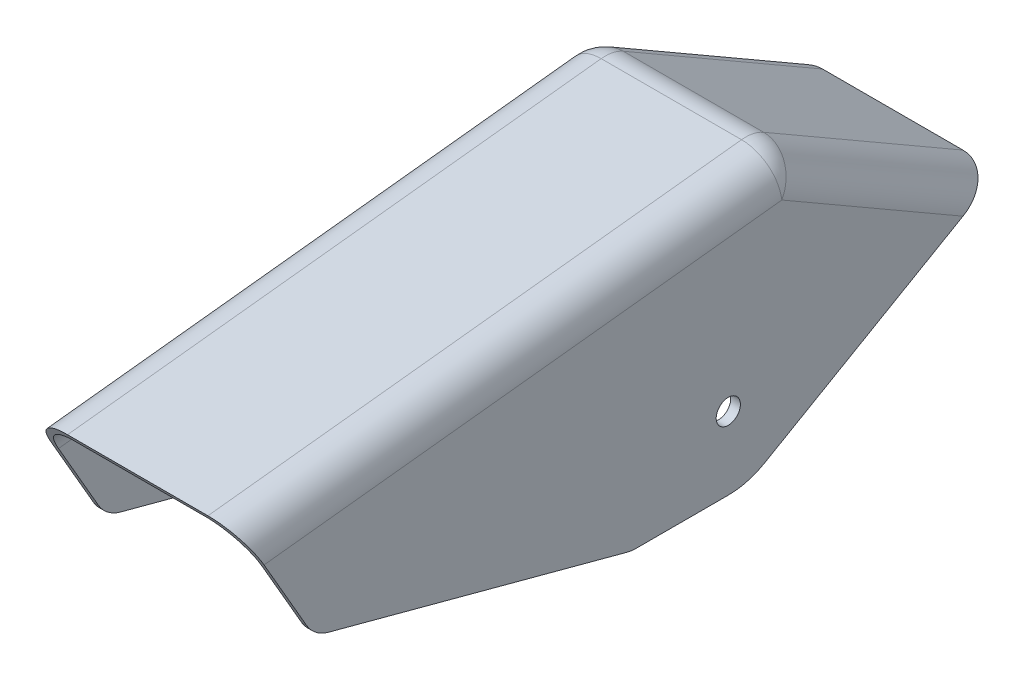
ISO-10303-21;
HEADER;
FILE_DESCRIPTION(('STEP AP214'),'2;1');
FILE_NAME('part.step','',(''),(''),'','','');
FILE_SCHEMA(('AUTOMOTIVE_DESIGN { 1 0 10303 214 1 1 1 1 }'));
ENDSEC;
DATA;
#1=APPLICATION_CONTEXT('core data for automotive mechanical design processes');
#2=APPLICATION_PROTOCOL_DEFINITION('international standard','automotive_design',2000,#1);
#3=PRODUCT_CONTEXT('',#1,'mechanical');
#4=PRODUCT('Part','Part','',(#3));
#5=PRODUCT_RELATED_PRODUCT_CATEGORY('part','',(#4));
#6=PRODUCT_DEFINITION_FORMATION('','',#4);
#7=PRODUCT_DEFINITION_CONTEXT('part definition',#1,'design');
#8=PRODUCT_DEFINITION('design','',#6,#7);
#9=PRODUCT_DEFINITION_SHAPE('','',#8);
#10=(LENGTH_UNIT() NAMED_UNIT(*) SI_UNIT(.MILLI.,.METRE.));
#11=(NAMED_UNIT(*) PLANE_ANGLE_UNIT() SI_UNIT($,.RADIAN.));
#12=(NAMED_UNIT(*) SI_UNIT($,.STERADIAN.) SOLID_ANGLE_UNIT());
#13=UNCERTAINTY_MEASURE_WITH_UNIT(LENGTH_MEASURE(1.E-05),#10,'distance_accuracy_value','');
#14=(GEOMETRIC_REPRESENTATION_CONTEXT(3) GLOBAL_UNCERTAINTY_ASSIGNED_CONTEXT((#13)) GLOBAL_UNIT_ASSIGNED_CONTEXT((#10,
#11,#12)) REPRESENTATION_CONTEXT('',''));
#15=CARTESIAN_POINT('',(0.,0.,0.));
#16=DIRECTION('',(0.,0.,1.));
#17=DIRECTION('',(1.,0.,0.));
#18=AXIS2_PLACEMENT_3D('',#15,#16,#17);
#19=CARTESIAN_POINT('',(210.,3.46944695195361E-13,0.));
#20=DIRECTION('',(1.,0.,0.));
#21=DIRECTION('',(0.,0.,-1.));
#22=AXIS2_PLACEMENT_3D('',#19,#20,#21);
#23=PLANE('',#22);
#24=CARTESIAN_POINT('',(210.,0.,0.));
#25=DIRECTION('',(1.,0.,0.));
#26=DIRECTION('',(0.,0.,-1.));
#27=AXIS2_PLACEMENT_3D('',#24,#25,#26);
#28=CIRCLE('',#27,35.);
#29=CARTESIAN_POINT('',(210.,0.,-35.));
#30=VERTEX_POINT('',#29);
#31=EDGE_CURVE('E365',#30,#30,#28,.T.);
#32=ORIENTED_EDGE('',*,*,#31,.T.);
#33=EDGE_LOOP('',(#32));
#34=FACE_BOUND('',#33,.T.);
#35=DIRECTION('',(0.,0.,-1.));
#36=VECTOR('',#35,1.);
#37=CARTESIAN_POINT('',(210.,-150.,0.));
#38=LINE('',#37,#36);
#39=CARTESIAN_POINT('',(210.,-150.,190.126062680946));
#40=VERTEX_POINT('',#39);
#41=CARTESIAN_POINT('',(210.,-150.,0.));
#42=VERTEX_POINT('',#41);
#43=EDGE_CURVE('E333',#40,#42,#38,.T.);
#44=ORIENTED_EDGE('',*,*,#43,.F.);
#45=CARTESIAN_POINT('',(210.,-75.,190.126062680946));
#46=DIRECTION('',(1.,0.,0.));
#47=DIRECTION('',(0.,0.,-1.));
#48=AXIS2_PLACEMENT_3D('',#45,#46,#47);
#49=CIRCLE('',#48,75.);
#50=CARTESIAN_POINT('',(210.,-147.44443697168,209.537491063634));
#51=VERTEX_POINT('',#50);
#52=EDGE_CURVE('E429',#40,#51,#49,.F.);
#53=ORIENTED_EDGE('',*,*,#52,.T.);
#54=DIRECTION('',(0.,0.258819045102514,0.96592582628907));
#55=VECTOR('',#54,1.);
#56=CARTESIAN_POINT('',(210.,-189.951905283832,50.8974596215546));
#57=LINE('',#56,#55);
#58=CARTESIAN_POINT('',(210.,17.6437424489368,825.65496439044));
#59=VERTEX_POINT('',#58);
#60=EDGE_CURVE('E350',#51,#59,#57,.T.);
#61=ORIENTED_EDGE('',*,*,#60,.T.);
#62=CARTESIAN_POINT('',(210.,90.0881794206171,806.243536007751));
#63=DIRECTION('',(1.,0.,0.));
#64=DIRECTION('',(0.,0.,-1.));
#65=AXIS2_PLACEMENT_3D('',#62,#63,#64);
#66=CIRCLE('',#65,75.);
#67=CARTESIAN_POINT('',(210.,52.5881794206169,871.195441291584));
#68=VERTEX_POINT('',#67);
#69=EDGE_CURVE('E427',#59,#68,#66,.F.);
#70=ORIENTED_EDGE('',*,*,#69,.T.);
#71=DIRECTION('',(0.,0.866025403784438,0.500000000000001));
#72=VECTOR('',#71,1.);
#73=CARTESIAN_POINT('',(210.,-364.0916470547,630.625231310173));
#74=LINE('',#73,#72);
#75=CARTESIAN_POINT('',(210.,195.289402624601,953.584030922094));
#76=VERTEX_POINT('',#75);
#77=EDGE_CURVE('E348',#68,#76,#74,.T.);
#78=ORIENTED_EDGE('',*,*,#77,.T.);
#79=DIRECTION('',(0.,-0.10966150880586,0.993968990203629));
#80=VECTOR('',#79,1.);
#81=CARTESIAN_POINT('',(210.,315.153191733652,-132.858155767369));
#82=LINE('',#81,#80);
#83=CARTESIAN_POINT('',(210.,312.457360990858,-108.423217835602));
#84=VERTEX_POINT('',#83);
#85=EDGE_CURVE('E380',#76,#84,#82,.F.);
#86=ORIENTED_EDGE('',*,*,#85,.T.);
#87=DIRECTION('',(0.,0.499999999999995,0.866025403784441));
#88=VECTOR('',#87,1.);
#89=CARTESIAN_POINT('',(210.,79.2745920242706,-512.307621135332));
#90=LINE('',#89,#88);
#91=CARTESIAN_POINT('',(210.,100.925227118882,-474.807621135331));
#92=VERTEX_POINT('',#91);
#93=EDGE_CURVE('E378',#84,#92,#90,.F.);
#94=ORIENTED_EDGE('',*,*,#93,.T.);
#95=DIRECTION('',(0.,-0.5,0.866025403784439));
#96=VECTOR('',#95,1.);
#97=CARTESIAN_POINT('',(210.,-129.903810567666,-75.));
#98=LINE('',#97,#96);
#99=CARTESIAN_POINT('',(210.,-129.903810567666,-75.));
#100=VERTEX_POINT('',#99);
#101=EDGE_CURVE('E346',#92,#100,#98,.T.);
#102=ORIENTED_EDGE('',*,*,#101,.T.);
#103=CARTESIAN_POINT('',(210.,3.46944695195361E-13,0.));
#104=DIRECTION('',(1.,0.,0.));
#105=DIRECTION('',(0.,0.,-1.));
#106=AXIS2_PLACEMENT_3D('',#103,#104,#105);
#107=CIRCLE('',#106,150.);
#108=EDGE_CURVE('E328',#42,#100,#107,.T.);
#109=ORIENTED_EDGE('',*,*,#108,.F.);
#110=EDGE_LOOP('',(#44,#53,#61,#70,#78,#86,#94,#102,#109));
#111=FACE_BOUND('',#110,.T.);
#112=ADVANCED_FACE('F90',(#34,#111),#23,.F.);
#113=CARTESIAN_POINT('',(210.,0.,0.));
#114=DIRECTION('',(-1.,0.,0.));
#115=DIRECTION('',(0.,0.,1.));
#116=AXIS2_PLACEMENT_3D('',#113,#114,#115);
#117=CYLINDRICAL_SURFACE('',#116,25.);
#118=CARTESIAN_POINT('',(200.,0.,0.));
#119=DIRECTION('',(1.,0.,0.));
#120=DIRECTION('',(0.,0.,-1.));
#121=AXIS2_PLACEMENT_3D('',#118,#119,#120);
#122=CIRCLE('',#121,25.);
#123=CARTESIAN_POINT('',(200.,0.,-25.));
#124=VERTEX_POINT('',#123);
#125=EDGE_CURVE('E364',#124,#124,#122,.T.);
#126=ORIENTED_EDGE('',*,*,#125,.F.);
#127=EDGE_LOOP('',(#126));
#128=FACE_BOUND('',#127,.T.);
#129=CARTESIAN_POINT('',(220.,0.,0.));
#130=DIRECTION('',(1.,0.,0.));
#131=DIRECTION('',(0.,0.,-1.));
#132=AXIS2_PLACEMENT_3D('',#129,#130,#131);
#133=CIRCLE('',#132,25.);
#134=CARTESIAN_POINT('',(220.,0.,-25.));
#135=VERTEX_POINT('',#134);
#136=EDGE_CURVE('E325',#135,#135,#133,.T.);
#137=ORIENTED_EDGE('',*,*,#136,.T.);
#138=EDGE_LOOP('',(#137));
#139=FACE_BOUND('',#138,.T.);
#140=ADVANCED_FACE('F582',(#128,#139),#117,.F.);
#141=CARTESIAN_POINT('',(210.,0.,0.));
#142=DIRECTION('',(-1.,0.,0.));
#143=DIRECTION('',(0.,0.,1.));
#144=AXIS2_PLACEMENT_3D('',#141,#142,#143);
#145=CYLINDRICAL_SURFACE('',#144,35.);
#146=ORIENTED_EDGE('',*,*,#31,.F.);
#147=EDGE_LOOP('',(#146));
#148=FACE_BOUND('',#147,.T.);
#149=CARTESIAN_POINT('',(200.,0.,0.));
#150=DIRECTION('',(1.,0.,0.));
#151=DIRECTION('',(0.,0.,-1.));
#152=AXIS2_PLACEMENT_3D('',#149,#150,#151);
#153=CIRCLE('',#152,35.);
#154=CARTESIAN_POINT('',(200.,0.,-35.));
#155=VERTEX_POINT('',#154);
#156=EDGE_CURVE('E369',#155,#155,#153,.T.);
#157=ORIENTED_EDGE('',*,*,#156,.T.);
#158=EDGE_LOOP('',(#157));
#159=FACE_BOUND('',#158,.T.);
#160=ADVANCED_FACE('F588',(#148,#159),#145,.T.);
#161=CARTESIAN_POINT('',(200.,0.,0.));
#162=DIRECTION('',(1.,0.,0.));
#163=DIRECTION('',(0.,0.,-1.));
#164=AXIS2_PLACEMENT_3D('',#161,#162,#163);
#165=PLANE('',#164);
#166=ORIENTED_EDGE('',*,*,#125,.T.);
#167=EDGE_LOOP('',(#166));
#168=FACE_BOUND('',#167,.T.);
#169=ORIENTED_EDGE('',*,*,#156,.F.);
#170=EDGE_LOOP('',(#169));
#171=FACE_BOUND('',#170,.T.);
#172=ADVANCED_FACE('F608',(#168,#171),#165,.F.);
#173=CARTESIAN_POINT('',(220.,3.46944695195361E-13,0.));
#174=DIRECTION('',(1.,0.,0.));
#175=DIRECTION('',(0.,0.,-1.));
#176=AXIS2_PLACEMENT_3D('',#173,#174,#175);
#177=PLANE('',#176);
#178=DIRECTION('',(0.,0.258819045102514,0.96592582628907));
#179=VECTOR('',#178,1.);
#180=CARTESIAN_POINT('',(220.,-189.951905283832,50.8974596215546));
#181=LINE('',#180,#179);
#182=CARTESIAN_POINT('',(220.,-147.44443697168,209.537491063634));
#183=VERTEX_POINT('',#182);
#184=CARTESIAN_POINT('',(220.,17.6437424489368,825.65496439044));
#185=VERTEX_POINT('',#184);
#186=EDGE_CURVE('E338',#183,#185,#181,.T.);
#187=ORIENTED_EDGE('',*,*,#186,.F.);
#188=CARTESIAN_POINT('',(220.,-75.,190.126062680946));
#189=DIRECTION('',(1.,0.,0.));
#190=DIRECTION('',(0.,0.,-1.));
#191=AXIS2_PLACEMENT_3D('',#188,#189,#190);
#192=CIRCLE('',#191,75.);
#193=CARTESIAN_POINT('',(220.,-150.,190.126062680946));
#194=VERTEX_POINT('',#193);
#195=EDGE_CURVE('E442',#183,#194,#192,.T.);
#196=ORIENTED_EDGE('',*,*,#195,.T.);
#197=DIRECTION('',(0.,0.,-1.));
#198=VECTOR('',#197,1.);
#199=CARTESIAN_POINT('',(220.,-150.,0.));
#200=LINE('',#199,#198);
#201=CARTESIAN_POINT('',(220.,-150.,0.));
#202=VERTEX_POINT('',#201);
#203=EDGE_CURVE('E341',#194,#202,#200,.T.);
#204=ORIENTED_EDGE('',*,*,#203,.T.);
#205=CARTESIAN_POINT('',(220.,3.46944695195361E-13,0.));
#206=DIRECTION('',(1.,0.,0.));
#207=DIRECTION('',(0.,0.,-1.));
#208=AXIS2_PLACEMENT_3D('',#205,#206,#207);
#209=CIRCLE('',#208,150.);
#210=CARTESIAN_POINT('',(220.,-129.903810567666,-75.));
#211=VERTEX_POINT('',#210);
#212=EDGE_CURVE('E329',#202,#211,#209,.T.);
#213=ORIENTED_EDGE('',*,*,#212,.T.);
#214=DIRECTION('',(0.,-0.5,0.866025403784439));
#215=VECTOR('',#214,1.);
#216=CARTESIAN_POINT('',(220.,-129.903810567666,-75.));
#217=LINE('',#216,#215);
#218=CARTESIAN_POINT('',(220.,106.698729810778,-484.807621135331));
#219=VERTEX_POINT('',#218);
#220=EDGE_CURVE('E332',#219,#211,#217,.T.);
#221=ORIENTED_EDGE('',*,*,#220,.F.);
#222=DIRECTION('',(0.,-0.499999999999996,-0.866025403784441));
#223=VECTOR('',#222,1.);
#224=CARTESIAN_POINT('',(220.,289.951905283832,-167.403810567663));
#225=LINE('',#224,#223);
#226=CARTESIAN_POINT('',(220.,322.756494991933,-110.58459447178));
#227=VERTEX_POINT('',#226);
#228=EDGE_CURVE('E436',#219,#227,#225,.F.);
#229=ORIENTED_EDGE('',*,*,#228,.T.);
#230=DIRECTION('',(0.,0.10966150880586,-0.993968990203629));
#231=VECTOR('',#230,1.);
#232=CARTESIAN_POINT('',(220.,306.8214032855,33.8506516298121));
#233=LINE('',#232,#231);
#234=CARTESIAN_POINT('',(220.,204.74761635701,959.044733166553));
#235=VERTEX_POINT('',#234);
#236=EDGE_CURVE('E438',#227,#235,#233,.F.);
#237=ORIENTED_EDGE('',*,*,#236,.T.);
#238=DIRECTION('',(0.,0.866025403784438,0.500000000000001));
#239=VECTOR('',#238,1.);
#240=CARTESIAN_POINT('',(220.,-364.0916470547,630.625231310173));
#241=LINE('',#240,#239);
#242=CARTESIAN_POINT('',(220.,52.5881794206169,871.195441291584));
#243=VERTEX_POINT('',#242);
#244=EDGE_CURVE('E335',#243,#235,#241,.T.);
#245=ORIENTED_EDGE('',*,*,#244,.F.);
#246=CARTESIAN_POINT('',(220.,90.0881794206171,806.243536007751));
#247=DIRECTION('',(1.,0.,0.));
#248=DIRECTION('',(0.,0.,-1.));
#249=AXIS2_PLACEMENT_3D('',#246,#247,#248);
#250=CIRCLE('',#249,75.);
#251=EDGE_CURVE('E440',#243,#185,#250,.T.);
#252=ORIENTED_EDGE('',*,*,#251,.T.);
#253=EDGE_LOOP('',(#187,#196,#204,#213,#221,#229,#237,#245,#252));
#254=FACE_BOUND('',#253,.T.);
#255=ORIENTED_EDGE('',*,*,#136,.F.);
#256=EDGE_LOOP('',(#255));
#257=FACE_BOUND('',#256,.T.);
#258=ADVANCED_FACE('F501',(#254,#257),#177,.T.);
#259=CARTESIAN_POINT('',(220.,3.46944695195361E-13,0.));
#260=DIRECTION('',(-1.,0.,0.));
#261=DIRECTION('',(0.,0.,1.));
#262=AXIS2_PLACEMENT_3D('',#259,#260,#261);
#263=CYLINDRICAL_SURFACE('',#262,150.);
#264=ORIENTED_EDGE('',*,*,#108,.T.);
#265=DIRECTION('',(-1.,0.,0.));
#266=VECTOR('',#265,1.);
#267=CARTESIAN_POINT('',(220.,-129.903810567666,-75.));
#268=LINE('',#267,#266);
#269=EDGE_CURVE('E361',#211,#100,#268,.T.);
#270=ORIENTED_EDGE('',*,*,#269,.F.);
#271=ORIENTED_EDGE('',*,*,#212,.F.);
#272=DIRECTION('',(-1.,0.,0.));
#273=VECTOR('',#272,1.);
#274=CARTESIAN_POINT('',(220.,-150.,0.));
#275=LINE('',#274,#273);
#276=EDGE_CURVE('E343',#202,#42,#275,.T.);
#277=ORIENTED_EDGE('',*,*,#276,.T.);
#278=EDGE_LOOP('',(#264,#270,#271,#277));
#279=FACE_BOUND('',#278,.T.);
#280=ADVANCED_FACE('F529',(#279),#263,.T.);
#281=CARTESIAN_POINT('',(220.,-129.903810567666,-75.));
#282=DIRECTION('',(0.,-0.866025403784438,-0.5));
#283=DIRECTION('',(0.,0.5,-0.866025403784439));
#284=AXIS2_PLACEMENT_3D('',#281,#282,#283);
#285=PLANE('',#284);
#286=DIRECTION('',(-1.,0.,0.));
#287=VECTOR('',#286,1.);
#288=CARTESIAN_POINT('',(220.,150.,-559.807621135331));
#289=LINE('',#288,#287);
#290=CARTESIAN_POINT('',(145.,150.,-559.807621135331));
#291=VERTEX_POINT('',#290);
#292=CARTESIAN_POINT('',(-145.,150.,-559.807621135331));
#293=VERTEX_POINT('',#292);
#294=EDGE_CURVE('E359',#291,#293,#289,.T.);
#295=ORIENTED_EDGE('',*,*,#294,.F.);
#296=CARTESIAN_POINT('',(145.,106.698729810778,-484.807621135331));
#297=DIRECTION('',(0.,-0.866025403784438,-0.5));
#298=DIRECTION('',(0.,0.5,-0.866025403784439));
#299=AXIS2_PLACEMENT_3D('',#296,#297,#298);
#300=ELLIPSE('',#299,86.6025403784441,75.);
#301=EDGE_CURVE('E12',#291,#219,#300,.T.);
#302=ORIENTED_EDGE('',*,*,#301,.T.);
#303=ORIENTED_EDGE('',*,*,#220,.T.);
#304=ORIENTED_EDGE('',*,*,#269,.T.);
#305=ORIENTED_EDGE('',*,*,#101,.F.);
#306=CARTESIAN_POINT('',(135.,100.925227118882,-474.807621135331));
#307=DIRECTION('',(0.,-0.866025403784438,-0.5));
#308=DIRECTION('',(0.,0.5,-0.866025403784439));
#309=AXIS2_PLACEMENT_3D('',#306,#307,#308);
#310=ELLIPSE('',#309,86.6025403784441,75.);
#311=CARTESIAN_POINT('',(135.,144.226497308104,-549.807621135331));
#312=VERTEX_POINT('',#311);
#313=EDGE_CURVE('E394',#92,#312,#310,.F.);
#314=ORIENTED_EDGE('',*,*,#313,.T.);
#315=DIRECTION('',(-1.,0.,0.));
#316=VECTOR('',#315,1.);
#317=CARTESIAN_POINT('',(220.,144.226497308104,-549.807621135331));
#318=LINE('',#317,#316);
#319=CARTESIAN_POINT('',(-135.,144.226497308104,-549.807621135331));
#320=VERTEX_POINT('',#319);
#321=EDGE_CURVE('E316',#312,#320,#318,.T.);
#322=ORIENTED_EDGE('',*,*,#321,.T.);
#323=CARTESIAN_POINT('',(-135.,100.925227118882,-474.807621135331));
#324=DIRECTION('',(0.,-0.866025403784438,-0.5));
#325=DIRECTION('',(0.,0.5,-0.866025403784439));
#326=AXIS2_PLACEMENT_3D('',#323,#324,#325);
#327=ELLIPSE('',#326,86.6025403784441,75.);
#328=CARTESIAN_POINT('',(-210.,100.925227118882,-474.807621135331));
#329=VERTEX_POINT('',#328);
#330=EDGE_CURVE('E396',#320,#329,#327,.F.);
#331=ORIENTED_EDGE('',*,*,#330,.T.);
#332=DIRECTION('',(0.,0.5,-0.866025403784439));
#333=VECTOR('',#332,1.);
#334=CARTESIAN_POINT('',(-210.,-129.903810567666,-75.));
#335=LINE('',#334,#333);
#336=CARTESIAN_POINT('',(-210.,-129.903810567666,-75.0000000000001));
#337=VERTEX_POINT('',#336);
#338=EDGE_CURVE('E277',#337,#329,#335,.T.);
#339=ORIENTED_EDGE('',*,*,#338,.F.);
#340=DIRECTION('',(1.,0.,0.));
#341=VECTOR('',#340,1.);
#342=CARTESIAN_POINT('',(-220.,-129.903810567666,-75.0000000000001));
#343=LINE('',#342,#341);
#344=CARTESIAN_POINT('',(-220.,-129.903810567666,-75.0000000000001));
#345=VERTEX_POINT('',#344);
#346=EDGE_CURVE('E273',#345,#337,#343,.T.);
#347=ORIENTED_EDGE('',*,*,#346,.F.);
#348=DIRECTION('',(0.,0.499999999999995,-0.866025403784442));
#349=VECTOR('',#348,1.);
#350=CARTESIAN_POINT('',(-220.,144.226497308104,-549.807621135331));
#351=LINE('',#350,#349);
#352=CARTESIAN_POINT('',(-220.,106.698729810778,-484.807621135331));
#353=VERTEX_POINT('',#352);
#354=EDGE_CURVE('E258',#345,#353,#351,.T.);
#355=ORIENTED_EDGE('',*,*,#354,.T.);
#356=CARTESIAN_POINT('',(-145.,106.698729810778,-484.807621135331));
#357=DIRECTION('',(0.,-0.866025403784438,-0.5));
#358=DIRECTION('',(0.,-0.5,0.866025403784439));
#359=AXIS2_PLACEMENT_3D('',#356,#357,#358);
#360=ELLIPSE('',#359,86.6025403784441,75.);
#361=EDGE_CURVE('E99',#353,#293,#360,.T.);
#362=ORIENTED_EDGE('',*,*,#361,.T.);
#363=EDGE_LOOP('',(#295,#302,#303,#304,#305,#314,#322,#331,#339,#347,#355,#362));
#364=FACE_BOUND('',#363,.T.);
#365=ADVANCED_FACE('F275',(#364),#285,.T.);
#366=CARTESIAN_POINT('',(220.,354.903810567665,-204.903810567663));
#367=DIRECTION('',(0.,0.866025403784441,-0.499999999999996));
#368=DIRECTION('',(0.,0.499999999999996,0.866025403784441));
#369=AXIS2_PLACEMENT_3D('',#366,#367,#368);
#370=PLANE('',#369);
#371=DIRECTION('',(-1.,0.,0.));
#372=VECTOR('',#371,1.);
#373=CARTESIAN_POINT('',(220.,387.708400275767,-148.084594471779));
#374=LINE('',#373,#372);
#375=CARTESIAN_POINT('',(-145.,387.708400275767,-148.084594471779));
#376=VERTEX_POINT('',#375);
#377=CARTESIAN_POINT('',(145.,387.708400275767,-148.084594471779));
#378=VERTEX_POINT('',#377);
#379=EDGE_CURVE('E107',#376,#378,#374,.F.);
#380=ORIENTED_EDGE('',*,*,#379,.T.);
#381=DIRECTION('',(0.,-0.499999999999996,-0.866025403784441));
#382=VECTOR('',#381,1.);
#383=CARTESIAN_POINT('',(145.,354.903810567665,-204.903810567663));
#384=LINE('',#383,#382);
#385=EDGE_CURVE('E462',#378,#291,#384,.T.);
#386=ORIENTED_EDGE('',*,*,#385,.T.);
#387=ORIENTED_EDGE('',*,*,#294,.T.);
#388=DIRECTION('',(0.,0.499999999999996,0.866025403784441));
#389=VECTOR('',#388,1.);
#390=CARTESIAN_POINT('',(-145.,354.903810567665,-204.903810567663));
#391=LINE('',#390,#389);
#392=EDGE_CURVE('E112',#293,#376,#391,.T.);
#393=ORIENTED_EDGE('',*,*,#392,.T.);
#394=EDGE_LOOP('',(#380,#386,#387,#393));
#395=FACE_BOUND('',#394,.T.);
#396=ADVANCED_FACE('F531',(#395),#370,.T.);
#397=CARTESIAN_POINT('',(220.,381.369077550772,42.0752647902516));
#398=DIRECTION('',(0.,0.993968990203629,0.10966150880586));
#399=DIRECTION('',(0.,-0.10966150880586,0.993968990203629));
#400=AXIS2_PLACEMENT_3D('',#397,#398,#399);
#401=PLANE('',#400);
#402=DIRECTION('',(-1.,0.,0.));
#403=VECTOR('',#402,1.);
#404=CARTESIAN_POINT('',(220.,275.68421935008,1000.));
#405=LINE('',#404,#403);
#406=CARTESIAN_POINT('',(145.,275.68421935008,1000.));
#407=VERTEX_POINT('',#406);
#408=CARTESIAN_POINT('',(-145.,275.68421935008,1000.));
#409=VERTEX_POINT('',#408);
#410=EDGE_CURVE('E356',#407,#409,#405,.T.);
#411=ORIENTED_EDGE('',*,*,#410,.F.);
#412=DIRECTION('',(0.,0.10966150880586,-0.993968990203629));
#413=VECTOR('',#412,1.);
#414=CARTESIAN_POINT('',(145.,381.369077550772,42.0752647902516));
#415=LINE('',#414,#413);
#416=CARTESIAN_POINT('',(145.,397.304169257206,-102.35998131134));
#417=VERTEX_POINT('',#416);
#418=EDGE_CURVE('E458',#407,#417,#415,.T.);
#419=ORIENTED_EDGE('',*,*,#418,.T.);
#420=DIRECTION('',(-1.,0.,0.));
#421=VECTOR('',#420,1.);
#422=CARTESIAN_POINT('',(220.,397.304169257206,-102.35998131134));
#423=LINE('',#422,#421);
#424=CARTESIAN_POINT('',(-145.,397.304169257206,-102.35998131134));
#425=VERTEX_POINT('',#424);
#426=EDGE_CURVE('E455',#417,#425,#423,.T.);
#427=ORIENTED_EDGE('',*,*,#426,.T.);
#428=DIRECTION('',(0.,-0.10966150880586,0.993968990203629));
#429=VECTOR('',#428,1.);
#430=CARTESIAN_POINT('',(-145.,381.369077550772,42.0752647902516));
#431=LINE('',#430,#429);
#432=EDGE_CURVE('E453',#425,#409,#431,.T.);
#433=ORIENTED_EDGE('',*,*,#432,.T.);
#434=EDGE_LOOP('',(#411,#419,#427,#433));
#435=FACE_BOUND('',#434,.T.);
#436=ADVANCED_FACE('F491',(#435),#401,.T.);
#437=CARTESIAN_POINT('',(220.,-364.0916470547,630.625231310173));
#438=DIRECTION('',(0.,-0.500000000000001,0.866025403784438));
#439=DIRECTION('',(0.,-0.866025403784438,-0.500000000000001));
#440=AXIS2_PLACEMENT_3D('',#437,#438,#439);
#441=PLANE('',#440);
#442=ORIENTED_EDGE('',*,*,#77,.F.);
#443=DIRECTION('',(-1.,0.,0.));
#444=VECTOR('',#443,1.);
#445=CARTESIAN_POINT('',(220.,52.5881794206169,871.195441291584));
#446=LINE('',#445,#444);
#447=EDGE_CURVE('E451',#68,#243,#446,.F.);
#448=ORIENTED_EDGE('',*,*,#447,.T.);
#449=ORIENTED_EDGE('',*,*,#244,.T.);
#450=CARTESIAN_POINT('',(145.,204.74761635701,959.044733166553));
#451=DIRECTION('',(0.,-0.500000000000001,0.866025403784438));
#452=DIRECTION('',(0.,-0.866025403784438,-0.500000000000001));
#453=AXIS2_PLACEMENT_3D('',#450,#451,#452);
#454=ELLIPSE('',#453,81.9105336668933,75.);
#455=EDGE_CURVE('E446',#235,#407,#454,.T.);
#456=ORIENTED_EDGE('',*,*,#455,.T.);
#457=ORIENTED_EDGE('',*,*,#410,.T.);
#458=CARTESIAN_POINT('',(-145.,204.74761635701,959.044733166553));
#459=DIRECTION('',(0.,-0.500000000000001,0.866025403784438));
#460=DIRECTION('',(0.,0.866025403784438,0.500000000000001));
#461=AXIS2_PLACEMENT_3D('',#458,#459,#460);
#462=ELLIPSE('',#461,81.9105336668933,75.);
#463=CARTESIAN_POINT('',(-220.,204.747616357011,959.044733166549));
#464=VERTEX_POINT('',#463);
#465=EDGE_CURVE('E444',#409,#464,#462,.T.);
#466=ORIENTED_EDGE('',*,*,#465,.T.);
#467=DIRECTION('',(0.,-0.866025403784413,-0.500000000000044));
#468=VECTOR('',#467,1.);
#469=CARTESIAN_POINT('',(-220.,275.68421935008,1000.));
#470=LINE('',#469,#468);
#471=CARTESIAN_POINT('',(-220.,52.5881794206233,871.195441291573));
#472=VERTEX_POINT('',#471);
#473=EDGE_CURVE('E269',#464,#472,#470,.T.);
#474=ORIENTED_EDGE('',*,*,#473,.T.);
#475=DIRECTION('',(1.,0.,0.));
#476=VECTOR('',#475,1.);
#477=CARTESIAN_POINT('',(220.,52.5881794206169,871.195441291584));
#478=LINE('',#477,#476);
#479=CARTESIAN_POINT('',(-210.,52.5881794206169,871.195441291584));
#480=VERTEX_POINT('',#479);
#481=EDGE_CURVE('E448',#472,#480,#478,.T.);
#482=ORIENTED_EDGE('',*,*,#481,.T.);
#483=DIRECTION('',(0.,-0.866025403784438,-0.500000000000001));
#484=VECTOR('',#483,1.);
#485=CARTESIAN_POINT('',(-210.,-364.0916470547,630.625231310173));
#486=LINE('',#485,#484);
#487=CARTESIAN_POINT('',(-210.,195.289402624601,953.584030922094));
#488=VERTEX_POINT('',#487);
#489=EDGE_CURVE('E301',#488,#480,#486,.T.);
#490=ORIENTED_EDGE('',*,*,#489,.F.);
#491=CARTESIAN_POINT('',(-135.,195.289402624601,953.584030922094));
#492=DIRECTION('',(0.,-0.500000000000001,0.866025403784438));
#493=DIRECTION('',(0.,-0.866025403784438,-0.500000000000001));
#494=AXIS2_PLACEMENT_3D('',#491,#492,#493);
#495=ELLIPSE('',#494,81.9105336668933,75.);
#496=CARTESIAN_POINT('',(-135.,266.226005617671,994.53929775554));
#497=VERTEX_POINT('',#496);
#498=EDGE_CURVE('E398',#488,#497,#495,.F.);
#499=ORIENTED_EDGE('',*,*,#498,.T.);
#500=DIRECTION('',(-1.,0.,0.));
#501=VECTOR('',#500,1.);
#502=CARTESIAN_POINT('',(220.,266.226005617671,994.53929775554));
#503=LINE('',#502,#501);
#504=CARTESIAN_POINT('',(135.,266.226005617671,994.53929775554));
#505=VERTEX_POINT('',#504);
#506=EDGE_CURVE('E322',#505,#497,#503,.T.);
#507=ORIENTED_EDGE('',*,*,#506,.F.);
#508=CARTESIAN_POINT('',(135.,195.289402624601,953.584030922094));
#509=DIRECTION('',(0.,-0.500000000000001,0.866025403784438));
#510=DIRECTION('',(0.,-0.866025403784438,-0.500000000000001));
#511=AXIS2_PLACEMENT_3D('',#508,#509,#510);
#512=ELLIPSE('',#511,81.9105336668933,75.);
#513=EDGE_CURVE('E391',#505,#76,#512,.F.);
#514=ORIENTED_EDGE('',*,*,#513,.T.);
#515=EDGE_LOOP('',(#442,#448,#449,#456,#457,#466,#474,#482,#490,#499,#507,#514));
#516=FACE_BOUND('',#515,.T.);
#517=ADVANCED_FACE('F507',(#516),#441,.T.);
#518=CARTESIAN_POINT('',(220.,-189.951905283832,50.8974596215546));
#519=DIRECTION('',(0.,-0.96592582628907,0.258819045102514));
#520=DIRECTION('',(0.,-0.258819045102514,-0.96592582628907));
#521=AXIS2_PLACEMENT_3D('',#518,#519,#520);
#522=PLANE('',#521);
#523=ORIENTED_EDGE('',*,*,#60,.F.);
#524=DIRECTION('',(-1.,0.,0.));
#525=VECTOR('',#524,1.);
#526=CARTESIAN_POINT('',(220.,-147.44443697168,209.537491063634));
#527=LINE('',#526,#525);
#528=EDGE_CURVE('E434',#51,#183,#527,.F.);
#529=ORIENTED_EDGE('',*,*,#528,.T.);
#530=ORIENTED_EDGE('',*,*,#186,.T.);
#531=DIRECTION('',(-1.,0.,0.));
#532=VECTOR('',#531,1.);
#533=CARTESIAN_POINT('',(220.,17.6437424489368,825.65496439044));
#534=LINE('',#533,#532);
#535=EDGE_CURVE('E431',#185,#59,#534,.T.);
#536=ORIENTED_EDGE('',*,*,#535,.T.);
#537=EDGE_LOOP('',(#523,#529,#530,#536));
#538=FACE_BOUND('',#537,.T.);
#539=ADVANCED_FACE('F515',(#538),#522,.T.);
#540=CARTESIAN_POINT('',(220.,-150.,0.));
#541=DIRECTION('',(0.,1.,0.));
#542=DIRECTION('',(0.,0.,1.));
#543=AXIS2_PLACEMENT_3D('',#540,#541,#542);
#544=PLANE('',#543);
#545=ORIENTED_EDGE('',*,*,#203,.F.);
#546=DIRECTION('',(-1.,0.,0.));
#547=VECTOR('',#546,1.);
#548=CARTESIAN_POINT('',(210.,-150.,190.126062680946));
#549=LINE('',#548,#547);
#550=EDGE_CURVE('E424',#194,#40,#549,.T.);
#551=ORIENTED_EDGE('',*,*,#550,.T.);
#552=ORIENTED_EDGE('',*,*,#43,.T.);
#553=ORIENTED_EDGE('',*,*,#276,.F.);
#554=EDGE_LOOP('',(#545,#551,#552,#553));
#555=FACE_BOUND('',#554,.T.);
#556=ADVANCED_FACE('F523',(#555),#544,.F.);
#557=CARTESIAN_POINT('',(220.,389.700865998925,-124.633542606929));
#558=DIRECTION('',(0.,0.866025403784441,-0.499999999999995));
#559=DIRECTION('',(0.,0.499999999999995,0.866025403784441));
#560=AXIS2_PLACEMENT_3D('',#557,#558,#559);
#561=PLANE('',#560);
#562=ORIENTED_EDGE('',*,*,#321,.F.);
#563=DIRECTION('',(0.,0.499999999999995,0.866025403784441));
#564=VECTOR('',#563,1.);
#565=CARTESIAN_POINT('',(135.,389.700865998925,-124.633542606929));
#566=LINE('',#565,#564);
#567=CARTESIAN_POINT('',(135.,389.700865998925,-124.633542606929));
#568=VERTEX_POINT('',#567);
#569=EDGE_CURVE('E385',#312,#568,#566,.T.);
#570=ORIENTED_EDGE('',*,*,#569,.T.);
#571=DIRECTION('',(-1.,0.,0.));
#572=VECTOR('',#571,1.);
#573=CARTESIAN_POINT('',(220.,389.700865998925,-124.633542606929));
#574=LINE('',#573,#572);
#575=CARTESIAN_POINT('',(-135.,389.700865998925,-124.633542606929));
#576=VERTEX_POINT('',#575);
#577=EDGE_CURVE('E319',#568,#576,#574,.T.);
#578=ORIENTED_EDGE('',*,*,#577,.T.);
#579=DIRECTION('',(0.,-0.499999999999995,-0.866025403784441));
#580=VECTOR('',#579,1.);
#581=CARTESIAN_POINT('',(-135.,389.700865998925,-124.633542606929));
#582=LINE('',#581,#580);
#583=EDGE_CURVE('E382',#576,#320,#582,.T.);
#584=ORIENTED_EDGE('',*,*,#583,.T.);
#585=EDGE_LOOP('',(#562,#570,#578,#584));
#586=FACE_BOUND('',#585,.T.);
#587=ADVANCED_FACE('F564',(#586),#561,.F.);
#588=CARTESIAN_POINT('',(220.,266.226005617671,994.53929775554));
#589=DIRECTION('',(0.,0.993968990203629,0.10966150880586));
#590=DIRECTION('',(0.,-0.10966150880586,0.993968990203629));
#591=AXIS2_PLACEMENT_3D('',#588,#589,#590);
#592=PLANE('',#591);
#593=ORIENTED_EDGE('',*,*,#577,.F.);
#594=DIRECTION('',(0.,-0.10966150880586,0.993968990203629));
#595=VECTOR('',#594,1.);
#596=CARTESIAN_POINT('',(135.,266.226005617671,994.53929775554));
#597=LINE('',#596,#595);
#598=EDGE_CURVE('E375',#568,#505,#597,.T.);
#599=ORIENTED_EDGE('',*,*,#598,.T.);
#600=ORIENTED_EDGE('',*,*,#506,.T.);
#601=DIRECTION('',(0.,0.10966150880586,-0.993968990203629));
#602=VECTOR('',#601,1.);
#603=CARTESIAN_POINT('',(-135.,266.226005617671,994.53929775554));
#604=LINE('',#603,#602);
#605=EDGE_CURVE('E368',#497,#576,#604,.T.);
#606=ORIENTED_EDGE('',*,*,#605,.T.);
#607=EDGE_LOOP('',(#593,#599,#600,#606));
#608=FACE_BOUND('',#607,.T.);
#609=ADVANCED_FACE('F575',(#608),#592,.F.);
#610=CARTESIAN_POINT('',(-220.,0.,0.));
#611=DIRECTION('',(-1.,0.,0.));
#612=DIRECTION('',(0.,0.,1.));
#613=AXIS2_PLACEMENT_3D('',#610,#611,#612);
#614=PLANE('',#613);
#615=DIRECTION('',(0.,0.,1.));
#616=VECTOR('',#615,1.);
#617=CARTESIAN_POINT('',(-220.,-150.,0.));
#618=LINE('',#617,#616);
#619=CARTESIAN_POINT('',(-220.,-150.,0.));
#620=VERTEX_POINT('',#619);
#621=CARTESIAN_POINT('',(-220.,-150.,190.126062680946));
#622=VERTEX_POINT('',#621);
#623=EDGE_CURVE('E290',#620,#622,#618,.T.);
#624=ORIENTED_EDGE('',*,*,#623,.T.);
#625=CARTESIAN_POINT('',(-220.,-75.,190.126062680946));
#626=DIRECTION('',(-1.,0.,0.));
#627=DIRECTION('',(0.,0.,1.));
#628=AXIS2_PLACEMENT_3D('',#625,#626,#627);
#629=CIRCLE('',#628,75.);
#630=CARTESIAN_POINT('',(-220.,-147.44443697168,209.537491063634));
#631=VERTEX_POINT('',#630);
#632=EDGE_CURVE('E422',#622,#631,#629,.T.);
#633=ORIENTED_EDGE('',*,*,#632,.T.);
#634=DIRECTION('',(0.,-0.258819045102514,-0.96592582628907));
#635=VECTOR('',#634,1.);
#636=CARTESIAN_POINT('',(-220.,-189.951905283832,50.8974596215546));
#637=LINE('',#636,#635);
#638=CARTESIAN_POINT('',(-220.,17.6437424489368,825.65496439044));
#639=VERTEX_POINT('',#638);
#640=EDGE_CURVE('E286',#639,#631,#637,.T.);
#641=ORIENTED_EDGE('',*,*,#640,.F.);
#642=CARTESIAN_POINT('',(-220.,90.088179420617,806.243536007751));
#643=DIRECTION('',(-1.,0.,0.));
#644=DIRECTION('',(0.,0.,1.));
#645=AXIS2_PLACEMENT_3D('',#642,#643,#644);
#646=CIRCLE('',#645,75.);
#647=EDGE_CURVE('E420',#639,#472,#646,.T.);
#648=ORIENTED_EDGE('',*,*,#647,.T.);
#649=ORIENTED_EDGE('',*,*,#473,.F.);
#650=DIRECTION('',(0.,-0.10966150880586,0.993968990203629));
#651=VECTOR('',#650,1.);
#652=CARTESIAN_POINT('',(-220.,306.8214032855,33.8506516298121));
#653=LINE('',#652,#651);
#654=CARTESIAN_POINT('',(-220.,322.756494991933,-110.584594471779));
#655=VERTEX_POINT('',#654);
#656=EDGE_CURVE('E417',#464,#655,#653,.F.);
#657=ORIENTED_EDGE('',*,*,#656,.T.);
#658=DIRECTION('',(0.,0.499999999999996,0.866025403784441));
#659=VECTOR('',#658,1.);
#660=CARTESIAN_POINT('',(-220.,289.951905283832,-167.403810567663));
#661=LINE('',#660,#659);
#662=EDGE_CURVE('E266',#655,#353,#661,.F.);
#663=ORIENTED_EDGE('',*,*,#662,.T.);
#664=ORIENTED_EDGE('',*,*,#354,.F.);
#665=CARTESIAN_POINT('',(-220.,3.46944695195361E-13,0.));
#666=DIRECTION('',(1.,0.,0.));
#667=DIRECTION('',(0.,0.,-1.));
#668=AXIS2_PLACEMENT_3D('',#665,#666,#667);
#669=CIRCLE('',#668,150.);
#670=EDGE_CURVE('E264',#620,#345,#669,.T.);
#671=ORIENTED_EDGE('',*,*,#670,.F.);
#672=EDGE_LOOP('',(#624,#633,#641,#648,#649,#657,#663,#664,#671));
#673=FACE_BOUND('',#672,.T.);
#674=CARTESIAN_POINT('',(-220.,0.,0.));
#675=DIRECTION('',(1.,0.,0.));
#676=DIRECTION('',(0.,0.,-1.));
#677=AXIS2_PLACEMENT_3D('',#674,#675,#676);
#678=CIRCLE('',#677,25.);
#679=CARTESIAN_POINT('',(-220.,0.,-25.));
#680=VERTEX_POINT('',#679);
#681=EDGE_CURVE('E298',#680,#680,#678,.T.);
#682=ORIENTED_EDGE('',*,*,#681,.T.);
#683=EDGE_LOOP('',(#682));
#684=FACE_BOUND('',#683,.T.);
#685=ADVANCED_FACE('F261',(#673,#684),#614,.T.);
#686=CARTESIAN_POINT('',(-210.,3.46944695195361E-13,0.));
#687=DIRECTION('',(1.,0.,0.));
#688=DIRECTION('',(0.,0.,-1.));
#689=AXIS2_PLACEMENT_3D('',#686,#687,#688);
#690=PLANE('',#689);
#691=CARTESIAN_POINT('',(-210.,0.,0.));
#692=DIRECTION('',(1.,0.,0.));
#693=DIRECTION('',(0.,0.,-1.));
#694=AXIS2_PLACEMENT_3D('',#691,#692,#693);
#695=CIRCLE('',#694,35.);
#696=CARTESIAN_POINT('',(-210.,0.,-35.));
#697=VERTEX_POINT('',#696);
#698=EDGE_CURVE('E281',#697,#697,#695,.T.);
#699=ORIENTED_EDGE('',*,*,#698,.F.);
#700=EDGE_LOOP('',(#699));
#701=FACE_BOUND('',#700,.T.);
#702=DIRECTION('',(0.,-0.258819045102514,-0.96592582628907));
#703=VECTOR('',#702,1.);
#704=CARTESIAN_POINT('',(-210.,-189.951905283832,50.8974596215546));
#705=LINE('',#704,#703);
#706=CARTESIAN_POINT('',(-210.,17.6437424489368,825.65496439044));
#707=VERTEX_POINT('',#706);
#708=CARTESIAN_POINT('',(-210.,-147.44443697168,209.537491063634));
#709=VERTEX_POINT('',#708);
#710=EDGE_CURVE('E297',#707,#709,#705,.T.);
#711=ORIENTED_EDGE('',*,*,#710,.T.);
#712=CARTESIAN_POINT('',(-210.,-75.,190.126062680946));
#713=DIRECTION('',(1.,0.,0.));
#714=DIRECTION('',(0.,0.,-1.));
#715=AXIS2_PLACEMENT_3D('',#712,#713,#714);
#716=CIRCLE('',#715,75.);
#717=CARTESIAN_POINT('',(-210.,-150.,190.126062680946));
#718=VERTEX_POINT('',#717);
#719=EDGE_CURVE('E413',#709,#718,#716,.T.);
#720=ORIENTED_EDGE('',*,*,#719,.T.);
#721=DIRECTION('',(0.,0.,1.));
#722=VECTOR('',#721,1.);
#723=CARTESIAN_POINT('',(-210.,-150.,0.));
#724=LINE('',#723,#722);
#725=CARTESIAN_POINT('',(-210.,-150.,0.));
#726=VERTEX_POINT('',#725);
#727=EDGE_CURVE('E294',#726,#718,#724,.T.);
#728=ORIENTED_EDGE('',*,*,#727,.F.);
#729=CARTESIAN_POINT('',(-210.,3.46944695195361E-13,0.));
#730=DIRECTION('',(1.,0.,0.));
#731=DIRECTION('',(0.,0.,-1.));
#732=AXIS2_PLACEMENT_3D('',#729,#730,#731);
#733=CIRCLE('',#732,150.);
#734=EDGE_CURVE('E305',#726,#337,#733,.T.);
#735=ORIENTED_EDGE('',*,*,#734,.T.);
#736=ORIENTED_EDGE('',*,*,#338,.T.);
#737=DIRECTION('',(0.,-0.499999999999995,-0.866025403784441));
#738=VECTOR('',#737,1.);
#739=CARTESIAN_POINT('',(-210.,281.291651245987,-162.403810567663));
#740=LINE('',#739,#738);
#741=CARTESIAN_POINT('',(-210.,312.457360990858,-108.423217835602));
#742=VERTEX_POINT('',#741);
#743=EDGE_CURVE('E389',#329,#742,#740,.F.);
#744=ORIENTED_EDGE('',*,*,#743,.T.);
#745=DIRECTION('',(0.,0.10966150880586,-0.993968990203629));
#746=VECTOR('',#745,1.);
#747=CARTESIAN_POINT('',(-210.,296.881713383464,32.7540365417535));
#748=LINE('',#747,#746);
#749=EDGE_CURVE('E387',#742,#488,#748,.F.);
#750=ORIENTED_EDGE('',*,*,#749,.T.);
#751=ORIENTED_EDGE('',*,*,#489,.T.);
#752=CARTESIAN_POINT('',(-210.,90.088179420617,806.243536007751));
#753=DIRECTION('',(1.,0.,0.));
#754=DIRECTION('',(0.,0.,-1.));
#755=AXIS2_PLACEMENT_3D('',#752,#753,#754);
#756=CIRCLE('',#755,75.);
#757=EDGE_CURVE('E411',#480,#707,#756,.T.);
#758=ORIENTED_EDGE('',*,*,#757,.T.);
#759=EDGE_LOOP('',(#711,#720,#728,#735,#736,#744,#750,#751,#758));
#760=FACE_BOUND('',#759,.T.);
#761=ADVANCED_FACE('F551',(#701,#760),#690,.T.);
#762=CARTESIAN_POINT('',(-210.,0.,0.));
#763=DIRECTION('',(1.,0.,0.));
#764=DIRECTION('',(0.,0.,-1.));
#765=AXIS2_PLACEMENT_3D('',#762,#763,#764);
#766=CYLINDRICAL_SURFACE('',#765,25.);
#767=CARTESIAN_POINT('',(-200.,0.,0.));
#768=DIRECTION('',(1.,0.,0.));
#769=DIRECTION('',(0.,0.,-1.));
#770=AXIS2_PLACEMENT_3D('',#767,#768,#769);
#771=CIRCLE('',#770,25.);
#772=CARTESIAN_POINT('',(-200.,0.,-25.));
#773=VERTEX_POINT('',#772);
#774=EDGE_CURVE('E309',#773,#773,#771,.T.);
#775=ORIENTED_EDGE('',*,*,#774,.T.);
#776=EDGE_LOOP('',(#775));
#777=FACE_BOUND('',#776,.T.);
#778=ORIENTED_EDGE('',*,*,#681,.F.);
#779=EDGE_LOOP('',(#778));
#780=FACE_BOUND('',#779,.T.);
#781=ADVANCED_FACE('F720',(#777,#780),#766,.F.);
#782=CARTESIAN_POINT('',(-210.,0.,0.));
#783=DIRECTION('',(1.,0.,0.));
#784=DIRECTION('',(0.,0.,-1.));
#785=AXIS2_PLACEMENT_3D('',#782,#783,#784);
#786=CYLINDRICAL_SURFACE('',#785,35.);
#787=ORIENTED_EDGE('',*,*,#698,.T.);
#788=EDGE_LOOP('',(#787));
#789=FACE_BOUND('',#788,.T.);
#790=CARTESIAN_POINT('',(-200.,0.,0.));
#791=DIRECTION('',(1.,0.,0.));
#792=DIRECTION('',(0.,0.,-1.));
#793=AXIS2_PLACEMENT_3D('',#790,#791,#792);
#794=CIRCLE('',#793,35.);
#795=CARTESIAN_POINT('',(-200.,0.,-35.));
#796=VERTEX_POINT('',#795);
#797=EDGE_CURVE('E270',#796,#796,#794,.T.);
#798=ORIENTED_EDGE('',*,*,#797,.F.);
#799=EDGE_LOOP('',(#798));
#800=FACE_BOUND('',#799,.T.);
#801=ADVANCED_FACE('F712',(#789,#800),#786,.T.);
#802=CARTESIAN_POINT('',(-200.,0.,0.));
#803=DIRECTION('',(1.,0.,0.));
#804=DIRECTION('',(0.,0.,-1.));
#805=AXIS2_PLACEMENT_3D('',#802,#803,#804);
#806=PLANE('',#805);
#807=ORIENTED_EDGE('',*,*,#774,.F.);
#808=EDGE_LOOP('',(#807));
#809=FACE_BOUND('',#808,.T.);
#810=ORIENTED_EDGE('',*,*,#797,.T.);
#811=EDGE_LOOP('',(#810));
#812=FACE_BOUND('',#811,.T.);
#813=ADVANCED_FACE('F704',(#809,#812),#806,.T.);
#814=CARTESIAN_POINT('',(-220.,-150.,0.));
#815=DIRECTION('',(0.,1.,0.));
#816=DIRECTION('',(0.,0.,1.));
#817=AXIS2_PLACEMENT_3D('',#814,#815,#816);
#818=PLANE('',#817);
#819=ORIENTED_EDGE('',*,*,#727,.T.);
#820=DIRECTION('',(1.,0.,0.));
#821=VECTOR('',#820,1.);
#822=CARTESIAN_POINT('',(-220.,-150.,190.126062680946));
#823=LINE('',#822,#821);
#824=EDGE_CURVE('E415',#718,#622,#823,.F.);
#825=ORIENTED_EDGE('',*,*,#824,.T.);
#826=ORIENTED_EDGE('',*,*,#623,.F.);
#827=DIRECTION('',(1.,0.,0.));
#828=VECTOR('',#827,1.);
#829=CARTESIAN_POINT('',(-220.,-150.,0.));
#830=LINE('',#829,#828);
#831=EDGE_CURVE('E282',#620,#726,#830,.T.);
#832=ORIENTED_EDGE('',*,*,#831,.T.);
#833=EDGE_LOOP('',(#819,#825,#826,#832));
#834=FACE_BOUND('',#833,.T.);
#835=ADVANCED_FACE('F696',(#834),#818,.F.);
#836=CARTESIAN_POINT('',(-220.,-189.951905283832,50.8974596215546));
#837=DIRECTION('',(0.,-0.96592582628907,0.258819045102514));
#838=DIRECTION('',(0.,-0.258819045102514,-0.96592582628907));
#839=AXIS2_PLACEMENT_3D('',#836,#837,#838);
#840=PLANE('',#839);
#841=ORIENTED_EDGE('',*,*,#640,.T.);
#842=DIRECTION('',(1.,0.,0.));
#843=VECTOR('',#842,1.);
#844=CARTESIAN_POINT('',(-210.,-147.44443697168,209.537491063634));
#845=LINE('',#844,#843);
#846=EDGE_CURVE('E408',#631,#709,#845,.T.);
#847=ORIENTED_EDGE('',*,*,#846,.T.);
#848=ORIENTED_EDGE('',*,*,#710,.F.);
#849=DIRECTION('',(1.,0.,0.));
#850=VECTOR('',#849,1.);
#851=CARTESIAN_POINT('',(-220.,17.6437424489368,825.65496439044));
#852=LINE('',#851,#850);
#853=EDGE_CURVE('E400',#707,#639,#852,.F.);
#854=ORIENTED_EDGE('',*,*,#853,.T.);
#855=EDGE_LOOP('',(#841,#847,#848,#854));
#856=FACE_BOUND('',#855,.T.);
#857=ADVANCED_FACE('F688',(#856),#840,.T.);
#858=CARTESIAN_POINT('',(-220.,3.46944695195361E-13,0.));
#859=DIRECTION('',(1.,0.,0.));
#860=DIRECTION('',(0.,0.,-1.));
#861=AXIS2_PLACEMENT_3D('',#858,#859,#860);
#862=CYLINDRICAL_SURFACE('',#861,150.);
#863=ORIENTED_EDGE('',*,*,#734,.F.);
#864=ORIENTED_EDGE('',*,*,#831,.F.);
#865=ORIENTED_EDGE('',*,*,#670,.T.);
#866=ORIENTED_EDGE('',*,*,#346,.T.);
#867=EDGE_LOOP('',(#863,#864,#865,#866));
#868=FACE_BOUND('',#867,.T.);
#869=ADVANCED_FACE('F284',(#868),#862,.T.);
#870=CARTESIAN_POINT('',(135.,324.748960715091,-87.1335426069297));
#871=DIRECTION('',(0.,-0.499999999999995,-0.866025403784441));
#872=DIRECTION('',(0.,0.866025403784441,-0.499999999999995));
#873=AXIS2_PLACEMENT_3D('',#870,#871,#872);
#874=CYLINDRICAL_SURFACE('',#873,75.);
#875=ORIENTED_EDGE('',*,*,#313,.F.);
#876=ORIENTED_EDGE('',*,*,#93,.F.);
#877=CARTESIAN_POINT('',(135.,312.457360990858,-108.423217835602));
#878=DIRECTION('',(0.,-0.2053860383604,-0.978681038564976));
#879=DIRECTION('',(0.,0.978681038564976,-0.2053860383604));
#880=AXIS2_PLACEMENT_3D('',#877,#878,#879);
#881=ELLIPSE('',#880,78.9261280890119,75.);
#882=EDGE_CURVE('E401',#568,#84,#881,.T.);
#883=ORIENTED_EDGE('',*,*,#882,.F.);
#884=ORIENTED_EDGE('',*,*,#569,.F.);
#885=EDGE_LOOP('',(#875,#876,#883,#884));
#886=FACE_BOUND('',#885,.T.);
#887=ADVANCED_FACE('F571',(#886),#874,.F.);
#888=CARTESIAN_POINT('',(135.,191.678331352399,986.3146845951));
#889=DIRECTION('',(0.,0.10966150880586,-0.993968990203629));
#890=DIRECTION('',(0.,0.993968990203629,0.10966150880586));
#891=AXIS2_PLACEMENT_3D('',#888,#889,#890);
#892=CYLINDRICAL_SURFACE('',#891,75.);
#893=ORIENTED_EDGE('',*,*,#882,.T.);
#894=ORIENTED_EDGE('',*,*,#85,.F.);
#895=ORIENTED_EDGE('',*,*,#513,.F.);
#896=ORIENTED_EDGE('',*,*,#598,.F.);
#897=EDGE_LOOP('',(#893,#894,#895,#896));
#898=FACE_BOUND('',#897,.T.);
#899=ADVANCED_FACE('F579',(#898),#892,.F.);
#900=CARTESIAN_POINT('',(-135.,191.678331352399,986.3146845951));
#901=DIRECTION('',(0.,0.10966150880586,-0.993968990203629));
#902=DIRECTION('',(0.,0.993968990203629,0.10966150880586));
#903=AXIS2_PLACEMENT_3D('',#900,#901,#902);
#904=CYLINDRICAL_SURFACE('',#903,75.);
#905=ORIENTED_EDGE('',*,*,#498,.F.);
#906=ORIENTED_EDGE('',*,*,#749,.F.);
#907=CARTESIAN_POINT('',(-135.,312.457360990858,-108.423217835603));
#908=DIRECTION('',(0.,-0.2053860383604,-0.978681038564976));
#909=DIRECTION('',(0.,-0.978681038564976,0.2053860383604));
#910=AXIS2_PLACEMENT_3D('',#907,#908,#909);
#911=ELLIPSE('',#910,78.9261280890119,75.);
#912=EDGE_CURVE('E404',#576,#742,#911,.F.);
#913=ORIENTED_EDGE('',*,*,#912,.F.);
#914=ORIENTED_EDGE('',*,*,#605,.F.);
#915=EDGE_LOOP('',(#905,#906,#913,#914));
#916=FACE_BOUND('',#915,.T.);
#917=ADVANCED_FACE('F557',(#916),#904,.F.);
#918=CARTESIAN_POINT('',(-135.,324.748960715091,-87.1335426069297));
#919=DIRECTION('',(0.,-0.499999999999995,-0.866025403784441));
#920=DIRECTION('',(0.,0.866025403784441,-0.499999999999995));
#921=AXIS2_PLACEMENT_3D('',#918,#919,#920);
#922=CYLINDRICAL_SURFACE('',#921,75.);
#923=ORIENTED_EDGE('',*,*,#912,.T.);
#924=ORIENTED_EDGE('',*,*,#743,.F.);
#925=ORIENTED_EDGE('',*,*,#330,.F.);
#926=ORIENTED_EDGE('',*,*,#583,.F.);
#927=EDGE_LOOP('',(#923,#924,#925,#926));
#928=FACE_BOUND('',#927,.T.);
#929=ADVANCED_FACE('F561',(#928),#922,.F.);
#930=CARTESIAN_POINT('',(-220.,-75.,190.126062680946));
#931=DIRECTION('',(-1.,0.,0.));
#932=DIRECTION('',(0.,0.,1.));
#933=AXIS2_PLACEMENT_3D('',#930,#931,#932);
#934=CYLINDRICAL_SURFACE('',#933,75.);
#935=ORIENTED_EDGE('',*,*,#632,.F.);
#936=ORIENTED_EDGE('',*,*,#824,.F.);
#937=ORIENTED_EDGE('',*,*,#719,.F.);
#938=ORIENTED_EDGE('',*,*,#846,.F.);
#939=EDGE_LOOP('',(#935,#936,#937,#938));
#940=FACE_BOUND('',#939,.T.);
#941=ADVANCED_FACE('F621',(#940),#934,.T.);
#942=CARTESIAN_POINT('',(220.,-75.,190.126062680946));
#943=DIRECTION('',(1.,0.,0.));
#944=DIRECTION('',(0.,0.,-1.));
#945=AXIS2_PLACEMENT_3D('',#942,#943,#944);
#946=CYLINDRICAL_SURFACE('',#945,75.);
#947=ORIENTED_EDGE('',*,*,#195,.F.);
#948=ORIENTED_EDGE('',*,*,#528,.F.);
#949=ORIENTED_EDGE('',*,*,#52,.F.);
#950=ORIENTED_EDGE('',*,*,#550,.F.);
#951=EDGE_LOOP('',(#947,#948,#949,#950));
#952=FACE_BOUND('',#951,.T.);
#953=ADVANCED_FACE('F518',(#952),#946,.T.);
#954=CARTESIAN_POINT('',(220.,90.0881794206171,806.243536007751));
#955=DIRECTION('',(-1.,0.,0.));
#956=DIRECTION('',(0.,0.,1.));
#957=AXIS2_PLACEMENT_3D('',#954,#955,#956);
#958=CYLINDRICAL_SURFACE('',#957,75.);
#959=ORIENTED_EDGE('',*,*,#251,.F.);
#960=ORIENTED_EDGE('',*,*,#447,.F.);
#961=ORIENTED_EDGE('',*,*,#69,.F.);
#962=ORIENTED_EDGE('',*,*,#535,.F.);
#963=EDGE_LOOP('',(#959,#960,#961,#962));
#964=FACE_BOUND('',#963,.T.);
#965=ADVANCED_FACE('F510',(#964),#958,.T.);
#966=CARTESIAN_POINT('',(220.,90.088179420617,806.243536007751));
#967=DIRECTION('',(1.,0.,0.));
#968=DIRECTION('',(0.,0.,-1.));
#969=AXIS2_PLACEMENT_3D('',#966,#967,#968);
#970=CYLINDRICAL_SURFACE('',#969,75.);
#971=ORIENTED_EDGE('',*,*,#647,.F.);
#972=ORIENTED_EDGE('',*,*,#853,.F.);
#973=ORIENTED_EDGE('',*,*,#757,.F.);
#974=ORIENTED_EDGE('',*,*,#481,.F.);
#975=EDGE_LOOP('',(#971,#972,#973,#974));
#976=FACE_BOUND('',#975,.T.);
#977=ADVANCED_FACE('F547',(#976),#970,.T.);
#978=CARTESIAN_POINT('',(145.,289.951905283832,-167.403810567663));
#979=DIRECTION('',(0.,-0.499999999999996,-0.866025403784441));
#980=DIRECTION('',(0.,0.866025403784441,-0.499999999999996));
#981=AXIS2_PLACEMENT_3D('',#978,#979,#980);
#982=CYLINDRICAL_SURFACE('',#981,75.);
#983=ORIENTED_EDGE('',*,*,#301,.F.);
#984=ORIENTED_EDGE('',*,*,#385,.F.);
#985=CARTESIAN_POINT('',(145.,322.756494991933,-110.58459447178));
#986=DIRECTION('',(0.,0.499999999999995,0.866025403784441));
#987=DIRECTION('',(0.,-0.866025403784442,0.499999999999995));
#988=AXIS2_PLACEMENT_3D('',#985,#986,#987);
#989=CIRCLE('',#988,75.);
#990=EDGE_CURVE('E94',#227,#378,#989,.T.);
#991=ORIENTED_EDGE('',*,*,#990,.F.);
#992=ORIENTED_EDGE('',*,*,#228,.F.);
#993=EDGE_LOOP('',(#983,#984,#991,#992));
#994=FACE_BOUND('',#993,.T.);
#995=ADVANCED_FACE('F92',(#994),#982,.T.);
#996=CARTESIAN_POINT('',(145.,306.8214032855,33.8506516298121));
#997=DIRECTION('',(0.,0.10966150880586,-0.993968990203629));
#998=DIRECTION('',(0.,0.993968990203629,0.10966150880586));
#999=AXIS2_PLACEMENT_3D('',#996,#997,#998);
#1000=CYLINDRICAL_SURFACE('',#999,75.);
#1001=ORIENTED_EDGE('',*,*,#455,.F.);
#1002=ORIENTED_EDGE('',*,*,#236,.F.);
#1003=CARTESIAN_POINT('',(145.,322.756494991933,-110.584594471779));
#1004=DIRECTION('',(0.,0.10966150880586,-0.993968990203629));
#1005=DIRECTION('',(0.,0.993968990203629,0.10966150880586));
#1006=AXIS2_PLACEMENT_3D('',#1003,#1004,#1005);
#1007=CIRCLE('',#1006,75.);
#1008=EDGE_CURVE('E475',#417,#227,#1007,.T.);
#1009=ORIENTED_EDGE('',*,*,#1008,.F.);
#1010=ORIENTED_EDGE('',*,*,#418,.F.);
#1011=EDGE_LOOP('',(#1001,#1002,#1009,#1010));
#1012=FACE_BOUND('',#1011,.T.);
#1013=ADVANCED_FACE('F497',(#1012),#1000,.T.);
#1014=CARTESIAN_POINT('',(-145.,306.8214032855,33.8506516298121));
#1015=DIRECTION('',(0.,-0.10966150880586,0.993968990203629));
#1016=DIRECTION('',(0.,-0.993968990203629,-0.10966150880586));
#1017=AXIS2_PLACEMENT_3D('',#1014,#1015,#1016);
#1018=CYLINDRICAL_SURFACE('',#1017,75.);
#1019=ORIENTED_EDGE('',*,*,#465,.F.);
#1020=ORIENTED_EDGE('',*,*,#432,.F.);
#1021=CARTESIAN_POINT('',(-145.,322.756494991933,-110.584594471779));
#1022=DIRECTION('',(0.,0.10966150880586,-0.993968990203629));
#1023=DIRECTION('',(0.,0.993968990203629,0.10966150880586));
#1024=AXIS2_PLACEMENT_3D('',#1021,#1022,#1023);
#1025=CIRCLE('',#1024,75.);
#1026=EDGE_CURVE('E473',#655,#425,#1025,.T.);
#1027=ORIENTED_EDGE('',*,*,#1026,.F.);
#1028=ORIENTED_EDGE('',*,*,#656,.F.);
#1029=EDGE_LOOP('',(#1019,#1020,#1027,#1028));
#1030=FACE_BOUND('',#1029,.T.);
#1031=ADVANCED_FACE('F540',(#1030),#1018,.T.);
#1032=CARTESIAN_POINT('',(-145.,289.951905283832,-167.403810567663));
#1033=DIRECTION('',(0.,0.499999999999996,0.866025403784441));
#1034=DIRECTION('',(0.,-0.866025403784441,0.499999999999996));
#1035=AXIS2_PLACEMENT_3D('',#1032,#1033,#1034);
#1036=CYLINDRICAL_SURFACE('',#1035,75.);
#1037=ORIENTED_EDGE('',*,*,#361,.F.);
#1038=ORIENTED_EDGE('',*,*,#662,.F.);
#1039=CARTESIAN_POINT('',(-145.,322.756494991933,-110.584594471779));
#1040=DIRECTION('',(0.,0.499999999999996,0.866025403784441));
#1041=DIRECTION('',(0.,-0.866025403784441,0.499999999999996));
#1042=AXIS2_PLACEMENT_3D('',#1039,#1040,#1041);
#1043=CIRCLE('',#1042,75.);
#1044=EDGE_CURVE('E470',#376,#655,#1043,.T.);
#1045=ORIENTED_EDGE('',*,*,#1044,.F.);
#1046=ORIENTED_EDGE('',*,*,#392,.F.);
#1047=EDGE_LOOP('',(#1037,#1038,#1045,#1046));
#1048=FACE_BOUND('',#1047,.T.);
#1049=ADVANCED_FACE('F533',(#1048),#1036,.T.);
#1050=CARTESIAN_POINT('',(145.,322.756494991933,-110.584594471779));
#1051=DIRECTION('',(1.,0.,0.));
#1052=DIRECTION('',(0.,0.,-1.));
#1053=AXIS2_PLACEMENT_3D('',#1050,#1051,#1052);
#1054=SPHERICAL_SURFACE('',#1053,75.);
#1055=ORIENTED_EDGE('',*,*,#1008,.T.);
#1056=ORIENTED_EDGE('',*,*,#990,.T.);
#1057=CARTESIAN_POINT('',(145.,322.756494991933,-110.584594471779));
#1058=DIRECTION('',(1.,0.,0.));
#1059=DIRECTION('',(0.,0.,-1.));
#1060=AXIS2_PLACEMENT_3D('',#1057,#1058,#1059);
#1061=CIRCLE('',#1060,75.);
#1062=EDGE_CURVE('E467',#417,#378,#1061,.F.);
#1063=ORIENTED_EDGE('',*,*,#1062,.F.);
#1064=EDGE_LOOP('',(#1055,#1056,#1063));
#1065=FACE_BOUND('',#1064,.T.);
#1066=ADVANCED_FACE('F482',(#1065),#1054,.T.);
#1067=CARTESIAN_POINT('',(-145.,322.756494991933,-110.584594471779));
#1068=DIRECTION('',(-1.,0.,0.));
#1069=DIRECTION('',(0.,0.,1.));
#1070=AXIS2_PLACEMENT_3D('',#1067,#1068,#1069);
#1071=SPHERICAL_SURFACE('',#1070,75.);
#1072=ORIENTED_EDGE('',*,*,#1044,.T.);
#1073=ORIENTED_EDGE('',*,*,#1026,.T.);
#1074=CARTESIAN_POINT('',(-145.,322.756494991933,-110.584594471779));
#1075=DIRECTION('',(-1.,0.,0.));
#1076=DIRECTION('',(0.,0.,1.));
#1077=AXIS2_PLACEMENT_3D('',#1074,#1075,#1076);
#1078=CIRCLE('',#1077,75.);
#1079=EDGE_CURVE('E465',#376,#425,#1078,.F.);
#1080=ORIENTED_EDGE('',*,*,#1079,.F.);
#1081=EDGE_LOOP('',(#1072,#1073,#1080));
#1082=FACE_BOUND('',#1081,.T.);
#1083=ADVANCED_FACE('F536',(#1082),#1071,.T.);
#1084=CARTESIAN_POINT('',(220.,322.756494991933,-110.584594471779));
#1085=DIRECTION('',(-1.,0.,0.));
#1086=DIRECTION('',(0.,0.,1.));
#1087=AXIS2_PLACEMENT_3D('',#1084,#1085,#1086);
#1088=CYLINDRICAL_SURFACE('',#1087,75.);
#1089=ORIENTED_EDGE('',*,*,#1062,.T.);
#1090=ORIENTED_EDGE('',*,*,#379,.F.);
#1091=ORIENTED_EDGE('',*,*,#1079,.T.);
#1092=ORIENTED_EDGE('',*,*,#426,.F.);
#1093=EDGE_LOOP('',(#1089,#1090,#1091,#1092));
#1094=FACE_BOUND('',#1093,.T.);
#1095=ADVANCED_FACE('F487',(#1094),#1088,.T.);
#1096=CLOSED_SHELL('',(#112,#140,#160,#172,#258,#280,#365,#396,#436,#517,#539,#556,#587,#609,
#685,#761,#781,#801,#813,#835,#857,#869,#887,#899,#917,#929,#941,#953,#965,#977,#995,#1013,
#1031,#1049,#1066,#1083,#1095));
#1097=MANIFOLD_SOLID_BREP('B2',#1096);
#1098=ADVANCED_BREP_SHAPE_REPRESENTATION('',(#18,#1097),#14);
#1099=SHAPE_DEFINITION_REPRESENTATION(#9,#1098);
ENDSEC;
END-ISO-10303-21;
